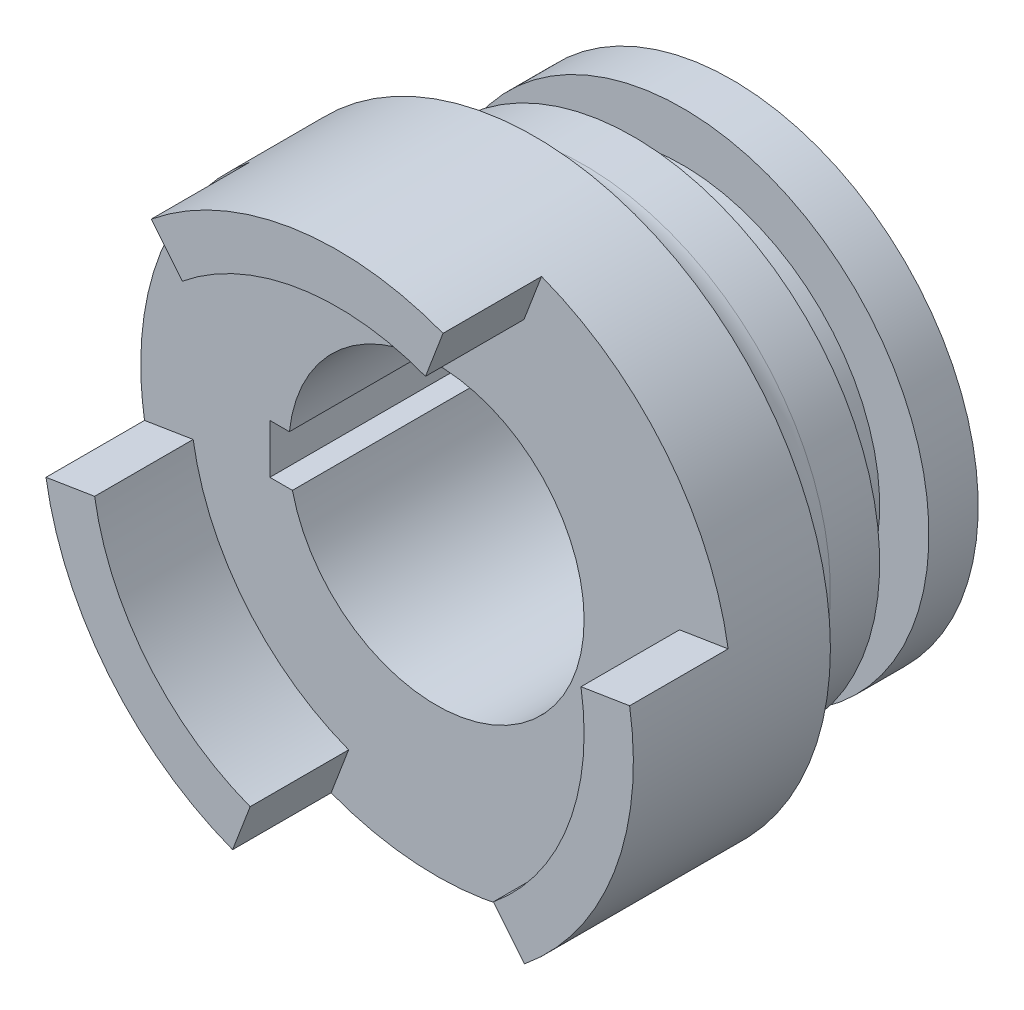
ISO-10303-21;
HEADER;
FILE_DESCRIPTION(('STEP AP214'),'2;1');
FILE_NAME('part.step','',(''),(''),'','','');
FILE_SCHEMA(('AUTOMOTIVE_DESIGN { 1 0 10303 214 1 1 1 1 }'));
ENDSEC;
DATA;
#1=APPLICATION_CONTEXT('core data for automotive mechanical design processes');
#2=APPLICATION_PROTOCOL_DEFINITION('international standard','automotive_design',2000,#1);
#3=PRODUCT_CONTEXT('',#1,'mechanical');
#4=PRODUCT('Part','Part','',(#3));
#5=PRODUCT_RELATED_PRODUCT_CATEGORY('part','',(#4));
#6=PRODUCT_DEFINITION_FORMATION('','',#4);
#7=PRODUCT_DEFINITION_CONTEXT('part definition',#1,'design');
#8=PRODUCT_DEFINITION('design','',#6,#7);
#9=PRODUCT_DEFINITION_SHAPE('','',#8);
#10=(LENGTH_UNIT() NAMED_UNIT(*) SI_UNIT(.MILLI.,.METRE.));
#11=(NAMED_UNIT(*) PLANE_ANGLE_UNIT() SI_UNIT($,.RADIAN.));
#12=(NAMED_UNIT(*) SI_UNIT($,.STERADIAN.) SOLID_ANGLE_UNIT());
#13=UNCERTAINTY_MEASURE_WITH_UNIT(LENGTH_MEASURE(1.E-05),#10,'distance_accuracy_value','');
#14=(GEOMETRIC_REPRESENTATION_CONTEXT(3) GLOBAL_UNCERTAINTY_ASSIGNED_CONTEXT((#13)) GLOBAL_UNIT_ASSIGNED_CONTEXT((#10,
#11,#12)) REPRESENTATION_CONTEXT('',''));
#15=CARTESIAN_POINT('',(0.,0.,0.));
#16=DIRECTION('',(0.,0.,1.));
#17=DIRECTION('',(1.,0.,0.));
#18=AXIS2_PLACEMENT_3D('',#15,#16,#17);
#19=CARTESIAN_POINT('',(-18.1237635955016,-40.2530135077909,51.980983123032));
#20=DIRECTION('',(0.,0.,-1.));
#21=DIRECTION('',(-1.,0.,0.));
#22=AXIS2_PLACEMENT_3D('',#19,#20,#21);
#23=PLANE('',#22);
#24=DIRECTION('',(1.,0.,0.));
#25=VECTOR('',#24,1.);
#26=CARTESIAN_POINT('',(-18.1237635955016,-38.6621044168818,51.980983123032));
#27=LINE('',#26,#25);
#28=CARTESIAN_POINT('',(-35.0190881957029,-38.6621044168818,51.980983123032));
#29=VERTEX_POINT('',#28);
#30=CARTESIAN_POINT('',(-33.039158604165,-38.6621044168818,51.980983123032));
#31=VERTEX_POINT('',#30);
#32=EDGE_CURVE('E177',#29,#31,#27,.T.);
#33=ORIENTED_EDGE('',*,*,#32,.T.);
#34=CARTESIAN_POINT('',(-18.1237635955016,-40.2530135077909,51.980983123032));
#35=DIRECTION('',(0.,0.,-1.));
#36=DIRECTION('',(-1.,0.,0.));
#37=AXIS2_PLACEMENT_3D('',#34,#35,#36);
#38=CIRCLE('',#37,15.);
#39=CARTESIAN_POINT('',(-32.7312308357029,-43.6621044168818,51.980983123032));
#40=VERTEX_POINT('',#39);
#41=EDGE_CURVE('E180',#31,#40,#38,.T.);
#42=ORIENTED_EDGE('',*,*,#41,.T.);
#43=DIRECTION('',(-1.,0.,0.));
#44=VECTOR('',#43,1.);
#45=CARTESIAN_POINT('',(-18.1237635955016,-43.6621044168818,51.980983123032));
#46=LINE('',#45,#44);
#47=CARTESIAN_POINT('',(-35.0190881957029,-43.6621044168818,51.980983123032));
#48=VERTEX_POINT('',#47);
#49=EDGE_CURVE('E172',#40,#48,#46,.T.);
#50=ORIENTED_EDGE('',*,*,#49,.T.);
#51=DIRECTION('',(0.,1.,0.));
#52=VECTOR('',#51,1.);
#53=CARTESIAN_POINT('',(-35.0190881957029,-40.2530135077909,51.980983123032));
#54=LINE('',#53,#52);
#55=EDGE_CURVE('E152',#48,#29,#54,.T.);
#56=ORIENTED_EDGE('',*,*,#55,.T.);
#57=EDGE_LOOP('',(#33,#42,#50,#56));
#58=FACE_BOUND('',#57,.T.);
#59=DIRECTION('',(0.355977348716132,0.934494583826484,0.));
#60=VECTOR('',#59,1.);
#61=CARTESIAN_POINT('',(-28.8030840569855,-68.2878510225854,51.980983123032));
#62=LINE('',#61,#60);
#63=CARTESIAN_POINT('',(-28.8030840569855,-68.2878510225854,51.980983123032));
#64=VERTEX_POINT('',#63);
#65=CARTESIAN_POINT('',(-27.0231973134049,-63.615378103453,51.980983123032));
#66=VERTEX_POINT('',#65);
#67=EDGE_CURVE('E198',#64,#66,#62,.T.);
#68=ORIENTED_EDGE('',*,*,#67,.F.);
#69=CARTESIAN_POINT('',(-18.1237635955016,-40.2530135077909,51.980983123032));
#70=DIRECTION('',(0.,0.,-1.));
#71=DIRECTION('',(-1.,0.,0.));
#72=AXIS2_PLACEMENT_3D('',#69,#70,#71);
#73=CIRCLE('',#72,30.);
#74=CARTESIAN_POINT('',(0.815457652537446,-63.5189950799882,51.980983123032));
#75=VERTEX_POINT('',#74);
#76=EDGE_CURVE('E262',#75,#64,#73,.T.);
#77=ORIENTED_EDGE('',*,*,#76,.F.);
#78=DIRECTION('',(0.631307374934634,-0.775532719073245,0.));
#79=VECTOR('',#78,1.);
#80=CARTESIAN_POINT('',(0.815457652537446,-63.5189950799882,51.980983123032));
#81=LINE('',#80,#79);
#82=CARTESIAN_POINT('',(-2.34107922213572,-59.641331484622,51.980983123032));
#83=VERTEX_POINT('',#82);
#84=EDGE_CURVE('E229',#83,#75,#81,.T.);
#85=ORIENTED_EDGE('',*,*,#84,.F.);
#86=CARTESIAN_POINT('',(-18.1237635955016,-40.2530135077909,51.980983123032));
#87=DIRECTION('',(0.,0.,-1.));
#88=DIRECTION('',(-1.,0.,0.));
#89=AXIS2_PLACEMENT_3D('',#86,#87,#88);
#90=CIRCLE('',#89,25.);
#91=CARTESIAN_POINT('',(6.55835449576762,-36.2789668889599,51.980983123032));
#92=VERTEX_POINT('',#91);
#93=EDGE_CURVE('E238',#92,#83,#90,.T.);
#94=ORIENTED_EDGE('',*,*,#93,.F.);
#95=DIRECTION('',(-0.987284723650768,-0.15896186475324,0.));
#96=VECTOR('',#95,1.);
#97=CARTESIAN_POINT('',(11.4947781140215,-35.4841575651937,51.980983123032));
#98=LINE('',#97,#96);
#99=CARTESIAN_POINT('',(11.4947781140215,-35.4841575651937,51.980983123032));
#100=VERTEX_POINT('',#99);
#101=EDGE_CURVE('E224',#100,#92,#98,.T.);
#102=ORIENTED_EDGE('',*,*,#101,.F.);
#103=CARTESIAN_POINT('',(-7.44444313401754,-12.2181759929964,51.980983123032));
#104=VERTEX_POINT('',#103);
#105=EDGE_CURVE('E259',#104,#100,#73,.T.);
#106=ORIENTED_EDGE('',*,*,#105,.F.);
#107=DIRECTION('',(0.355977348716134,0.934494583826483,0.));
#108=VECTOR('',#107,1.);
#109=CARTESIAN_POINT('',(-7.44444313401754,-12.2181759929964,51.980983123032));
#110=LINE('',#109,#108);
#111=CARTESIAN_POINT('',(-9.22432987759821,-16.8906489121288,51.980983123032));
#112=VERTEX_POINT('',#111);
#113=EDGE_CURVE('E267',#112,#104,#110,.T.);
#114=ORIENTED_EDGE('',*,*,#113,.F.);
#115=CARTESIAN_POINT('',(-18.1237635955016,-40.2530135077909,51.980983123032));
#116=DIRECTION('',(0.,0.,-1.));
#117=DIRECTION('',(-1.,0.,0.));
#118=AXIS2_PLACEMENT_3D('',#115,#116,#117);
#119=CIRCLE('',#118,25.);
#120=CARTESIAN_POINT('',(-33.9064479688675,-20.8646955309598,51.980983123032));
#121=VERTEX_POINT('',#120);
#122=EDGE_CURVE('E276',#121,#112,#119,.T.);
#123=ORIENTED_EDGE('',*,*,#122,.F.);
#124=DIRECTION('',(0.631307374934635,-0.775532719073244,0.));
#125=VECTOR('',#124,1.);
#126=CARTESIAN_POINT('',(-37.0629848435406,-16.9870319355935,51.980983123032));
#127=LINE('',#126,#125);
#128=CARTESIAN_POINT('',(-37.0629848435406,-16.9870319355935,51.980983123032));
#129=VERTEX_POINT('',#128);
#130=EDGE_CURVE('E258',#129,#121,#127,.T.);
#131=ORIENTED_EDGE('',*,*,#130,.F.);
#132=CARTESIAN_POINT('',(-47.7423053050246,-45.021869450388,51.980983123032));
#133=VERTEX_POINT('',#132);
#134=EDGE_CURVE('E254',#133,#129,#73,.T.);
#135=ORIENTED_EDGE('',*,*,#134,.F.);
#136=DIRECTION('',(-0.987284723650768,-0.158961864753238,0.));
#137=VECTOR('',#136,1.);
#138=CARTESIAN_POINT('',(-47.7423053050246,-45.021869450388,51.980983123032));
#139=LINE('',#138,#137);
#140=CARTESIAN_POINT('',(-42.8058816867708,-44.2270601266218,51.980983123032));
#141=VERTEX_POINT('',#140);
#142=EDGE_CURVE('E203',#141,#133,#139,.T.);
#143=ORIENTED_EDGE('',*,*,#142,.F.);
#144=CARTESIAN_POINT('',(-18.1237635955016,-40.2530135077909,51.980983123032));
#145=DIRECTION('',(0.,0.,-1.));
#146=DIRECTION('',(-1.,0.,0.));
#147=AXIS2_PLACEMENT_3D('',#144,#145,#146);
#148=CIRCLE('',#147,25.);
#149=EDGE_CURVE('E211',#66,#141,#148,.T.);
#150=ORIENTED_EDGE('',*,*,#149,.F.);
#151=EDGE_LOOP('',(#68,#77,#85,#94,#102,#106,#114,#123,#131,#135,#143,#150));
#152=FACE_BOUND('',#151,.T.);
#153=ADVANCED_FACE('F33',(#58,#152),#23,.F.);
#154=CARTESIAN_POINT('',(-18.1237635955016,-40.2530135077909,61.980983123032));
#155=DIRECTION('',(0.,0.,-1.));
#156=DIRECTION('',(-1.,0.,0.));
#157=AXIS2_PLACEMENT_3D('',#154,#155,#156);
#158=CYLINDRICAL_SURFACE('',#157,30.);
#159=DIRECTION('',(0.,0.,-1.));
#160=VECTOR('',#159,1.);
#161=CARTESIAN_POINT('',(-7.44444313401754,-12.2181759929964,61.980983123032));
#162=LINE('',#161,#160);
#163=CARTESIAN_POINT('',(-7.44444313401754,-12.2181759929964,61.980983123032));
#164=VERTEX_POINT('',#163);
#165=EDGE_CURVE('E273',#164,#104,#162,.T.);
#166=ORIENTED_EDGE('',*,*,#165,.T.);
#167=ORIENTED_EDGE('',*,*,#105,.T.);
#168=DIRECTION('',(0.,0.,-1.));
#169=VECTOR('',#168,1.);
#170=CARTESIAN_POINT('',(11.4947781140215,-35.4841575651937,61.980983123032));
#171=LINE('',#170,#169);
#172=CARTESIAN_POINT('',(11.4947781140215,-35.4841575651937,61.980983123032));
#173=VERTEX_POINT('',#172);
#174=EDGE_CURVE('E251',#173,#100,#171,.T.);
#175=ORIENTED_EDGE('',*,*,#174,.F.);
#176=CARTESIAN_POINT('',(-18.1237635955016,-40.2530135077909,61.980983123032));
#177=DIRECTION('',(0.,0.,1.));
#178=DIRECTION('',(1.,0.,0.));
#179=AXIS2_PLACEMENT_3D('',#176,#177,#178);
#180=CIRCLE('',#179,30.);
#181=CARTESIAN_POINT('',(0.815457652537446,-63.5189950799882,61.980983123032));
#182=VERTEX_POINT('',#181);
#183=EDGE_CURVE('E225',#182,#173,#180,.T.);
#184=ORIENTED_EDGE('',*,*,#183,.F.);
#185=DIRECTION('',(0.,0.,-1.));
#186=VECTOR('',#185,1.);
#187=CARTESIAN_POINT('',(0.815457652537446,-63.5189950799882,61.980983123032));
#188=LINE('',#187,#186);
#189=EDGE_CURVE('E235',#182,#75,#188,.T.);
#190=ORIENTED_EDGE('',*,*,#189,.T.);
#191=ORIENTED_EDGE('',*,*,#76,.T.);
#192=DIRECTION('',(0.,0.,-1.));
#193=VECTOR('',#192,1.);
#194=CARTESIAN_POINT('',(-28.8030840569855,-68.2878510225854,61.980983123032));
#195=LINE('',#194,#193);
#196=CARTESIAN_POINT('',(-28.8030840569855,-68.2878510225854,61.980983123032));
#197=VERTEX_POINT('',#196);
#198=EDGE_CURVE('E222',#197,#64,#195,.T.);
#199=ORIENTED_EDGE('',*,*,#198,.F.);
#200=CARTESIAN_POINT('',(-18.1237635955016,-40.2530135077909,61.980983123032));
#201=DIRECTION('',(0.,0.,1.));
#202=DIRECTION('',(1.,0.,0.));
#203=AXIS2_PLACEMENT_3D('',#200,#201,#202);
#204=CIRCLE('',#203,30.);
#205=CARTESIAN_POINT('',(-47.7423053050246,-45.021869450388,61.980983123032));
#206=VERTEX_POINT('',#205);
#207=EDGE_CURVE('E199',#206,#197,#204,.T.);
#208=ORIENTED_EDGE('',*,*,#207,.F.);
#209=DIRECTION('',(0.,0.,-1.));
#210=VECTOR('',#209,1.);
#211=CARTESIAN_POINT('',(-47.7423053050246,-45.021869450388,61.980983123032));
#212=LINE('',#211,#210);
#213=EDGE_CURVE('E209',#206,#133,#212,.T.);
#214=ORIENTED_EDGE('',*,*,#213,.T.);
#215=ORIENTED_EDGE('',*,*,#134,.T.);
#216=DIRECTION('',(0.,0.,-1.));
#217=VECTOR('',#216,1.);
#218=CARTESIAN_POINT('',(-37.0629848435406,-16.9870319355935,61.980983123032));
#219=LINE('',#218,#217);
#220=CARTESIAN_POINT('',(-37.0629848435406,-16.9870319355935,61.980983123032));
#221=VERTEX_POINT('',#220);
#222=EDGE_CURVE('E41',#221,#129,#219,.T.);
#223=ORIENTED_EDGE('',*,*,#222,.F.);
#224=CARTESIAN_POINT('',(-18.1237635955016,-40.2530135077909,61.980983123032));
#225=DIRECTION('',(0.,0.,1.));
#226=DIRECTION('',(1.,0.,0.));
#227=AXIS2_PLACEMENT_3D('',#224,#225,#226);
#228=CIRCLE('',#227,30.);
#229=EDGE_CURVE('E263',#164,#221,#228,.T.);
#230=ORIENTED_EDGE('',*,*,#229,.F.);
#231=EDGE_LOOP('',(#166,#167,#175,#184,#190,#191,#199,#208,#214,#215,#223,#230));
#232=FACE_BOUND('',#231,.T.);
#233=CARTESIAN_POINT('',(-18.1237635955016,-40.2530135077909,41.980983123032));
#234=DIRECTION('',(0.,0.,-1.));
#235=DIRECTION('',(-1.,0.,0.));
#236=AXIS2_PLACEMENT_3D('',#233,#234,#235);
#237=CIRCLE('',#236,30.);
#238=CARTESIAN_POINT('',(-48.1237635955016,-40.2530135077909,41.980983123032));
#239=VERTEX_POINT('',#238);
#240=EDGE_CURVE('E255',#239,#239,#237,.T.);
#241=ORIENTED_EDGE('',*,*,#240,.F.);
#242=EDGE_LOOP('',(#241));
#243=FACE_BOUND('',#242,.T.);
#244=ADVANCED_FACE('F296',(#232,#243),#158,.T.);
#245=CARTESIAN_POINT('',(-37.0629848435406,-16.9870319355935,61.980983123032));
#246=DIRECTION('',(0.775532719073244,0.631307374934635,0.));
#247=DIRECTION('',(-0.631307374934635,0.775532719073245,0.));
#248=AXIS2_PLACEMENT_3D('',#245,#246,#247);
#249=PLANE('',#248);
#250=ORIENTED_EDGE('',*,*,#130,.T.);
#251=DIRECTION('',(0.,0.,-1.));
#252=VECTOR('',#251,1.);
#253=CARTESIAN_POINT('',(-33.9064479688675,-20.8646955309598,61.980983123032));
#254=LINE('',#253,#252);
#255=CARTESIAN_POINT('',(-33.9064479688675,-20.8646955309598,61.980983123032));
#256=VERTEX_POINT('',#255);
#257=EDGE_CURVE('E286',#256,#121,#254,.T.);
#258=ORIENTED_EDGE('',*,*,#257,.F.);
#259=DIRECTION('',(0.631307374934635,-0.775532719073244,0.));
#260=VECTOR('',#259,1.);
#261=CARTESIAN_POINT('',(-37.0629848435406,-16.9870319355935,61.980983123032));
#262=LINE('',#261,#260);
#263=EDGE_CURVE('E266',#221,#256,#262,.T.);
#264=ORIENTED_EDGE('',*,*,#263,.F.);
#265=ORIENTED_EDGE('',*,*,#222,.T.);
#266=EDGE_LOOP('',(#250,#258,#264,#265));
#267=FACE_BOUND('',#266,.T.);
#268=ADVANCED_FACE('F291',(#267),#249,.F.);
#269=CARTESIAN_POINT('',(-18.1237635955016,-40.2530135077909,61.980983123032));
#270=DIRECTION('',(0.,0.,-1.));
#271=DIRECTION('',(-1.,0.,0.));
#272=AXIS2_PLACEMENT_3D('',#269,#270,#271);
#273=CYLINDRICAL_SURFACE('',#272,25.);
#274=ORIENTED_EDGE('',*,*,#122,.T.);
#275=DIRECTION('',(0.,0.,-1.));
#276=VECTOR('',#275,1.);
#277=CARTESIAN_POINT('',(-9.22432987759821,-16.8906489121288,61.980983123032));
#278=LINE('',#277,#276);
#279=CARTESIAN_POINT('',(-9.22432987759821,-16.8906489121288,61.980983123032));
#280=VERTEX_POINT('',#279);
#281=EDGE_CURVE('E283',#280,#112,#278,.T.);
#282=ORIENTED_EDGE('',*,*,#281,.F.);
#283=CARTESIAN_POINT('',(-18.1237635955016,-40.2530135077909,61.980983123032));
#284=DIRECTION('',(0.,0.,-1.));
#285=DIRECTION('',(-1.,0.,0.));
#286=AXIS2_PLACEMENT_3D('',#283,#284,#285);
#287=CIRCLE('',#286,25.);
#288=EDGE_CURVE('E269',#256,#280,#287,.T.);
#289=ORIENTED_EDGE('',*,*,#288,.F.);
#290=ORIENTED_EDGE('',*,*,#257,.T.);
#291=EDGE_LOOP('',(#274,#282,#289,#290));
#292=FACE_BOUND('',#291,.T.);
#293=ADVANCED_FACE('F306',(#292),#273,.F.);
#294=CARTESIAN_POINT('',(-7.44444313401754,-12.2181759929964,61.980983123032));
#295=DIRECTION('',(-0.934494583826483,0.355977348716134,0.));
#296=DIRECTION('',(-0.355977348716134,-0.934494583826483,0.));
#297=AXIS2_PLACEMENT_3D('',#294,#295,#296);
#298=PLANE('',#297);
#299=ORIENTED_EDGE('',*,*,#113,.T.);
#300=ORIENTED_EDGE('',*,*,#165,.F.);
#301=DIRECTION('',(0.355977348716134,0.934494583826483,0.));
#302=VECTOR('',#301,1.);
#303=CARTESIAN_POINT('',(-7.44444313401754,-12.2181759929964,61.980983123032));
#304=LINE('',#303,#302);
#305=EDGE_CURVE('E271',#280,#164,#304,.T.);
#306=ORIENTED_EDGE('',*,*,#305,.F.);
#307=ORIENTED_EDGE('',*,*,#281,.T.);
#308=EDGE_LOOP('',(#299,#300,#306,#307));
#309=FACE_BOUND('',#308,.T.);
#310=ADVANCED_FACE('F310',(#309),#298,.F.);
#311=CARTESIAN_POINT('',(-18.1237635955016,-40.2530135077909,61.980983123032));
#312=DIRECTION('',(0.,0.,1.));
#313=DIRECTION('',(1.,0.,0.));
#314=AXIS2_PLACEMENT_3D('',#311,#312,#313);
#315=PLANE('',#314);
#316=ORIENTED_EDGE('',*,*,#229,.T.);
#317=ORIENTED_EDGE('',*,*,#263,.T.);
#318=ORIENTED_EDGE('',*,*,#288,.T.);
#319=ORIENTED_EDGE('',*,*,#305,.T.);
#320=EDGE_LOOP('',(#316,#317,#318,#319));
#321=FACE_BOUND('',#320,.T.);
#322=ADVANCED_FACE('F313',(#321),#315,.T.);
#323=CARTESIAN_POINT('',(11.4947781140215,-35.4841575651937,61.980983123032));
#324=DIRECTION('',(0.15896186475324,-0.987284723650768,0.));
#325=DIRECTION('',(0.987284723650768,0.15896186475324,0.));
#326=AXIS2_PLACEMENT_3D('',#323,#324,#325);
#327=PLANE('',#326);
#328=ORIENTED_EDGE('',*,*,#101,.T.);
#329=DIRECTION('',(0.,0.,-1.));
#330=VECTOR('',#329,1.);
#331=CARTESIAN_POINT('',(6.55835449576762,-36.2789668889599,61.980983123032));
#332=LINE('',#331,#330);
#333=CARTESIAN_POINT('',(6.55835449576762,-36.2789668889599,61.980983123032));
#334=VERTEX_POINT('',#333);
#335=EDGE_CURVE('E248',#334,#92,#332,.T.);
#336=ORIENTED_EDGE('',*,*,#335,.F.);
#337=DIRECTION('',(-0.987284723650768,-0.15896186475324,0.));
#338=VECTOR('',#337,1.);
#339=CARTESIAN_POINT('',(11.4947781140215,-35.4841575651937,61.980983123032));
#340=LINE('',#339,#338);
#341=EDGE_CURVE('E228',#173,#334,#340,.T.);
#342=ORIENTED_EDGE('',*,*,#341,.F.);
#343=ORIENTED_EDGE('',*,*,#174,.T.);
#344=EDGE_LOOP('',(#328,#336,#342,#343));
#345=FACE_BOUND('',#344,.T.);
#346=ADVANCED_FACE('F315',(#345),#327,.F.);
#347=CARTESIAN_POINT('',(-18.1237635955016,-40.2530135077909,61.980983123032));
#348=DIRECTION('',(0.,0.,-1.));
#349=DIRECTION('',(-1.,0.,0.));
#350=AXIS2_PLACEMENT_3D('',#347,#348,#349);
#351=CYLINDRICAL_SURFACE('',#350,25.);
#352=ORIENTED_EDGE('',*,*,#93,.T.);
#353=DIRECTION('',(0.,0.,-1.));
#354=VECTOR('',#353,1.);
#355=CARTESIAN_POINT('',(-2.34107922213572,-59.641331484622,61.980983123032));
#356=LINE('',#355,#354);
#357=CARTESIAN_POINT('',(-2.34107922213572,-59.641331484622,61.980983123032));
#358=VERTEX_POINT('',#357);
#359=EDGE_CURVE('E245',#358,#83,#356,.T.);
#360=ORIENTED_EDGE('',*,*,#359,.F.);
#361=CARTESIAN_POINT('',(-18.1237635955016,-40.2530135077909,61.980983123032));
#362=DIRECTION('',(0.,0.,-1.));
#363=DIRECTION('',(-1.,0.,0.));
#364=AXIS2_PLACEMENT_3D('',#361,#362,#363);
#365=CIRCLE('',#364,25.);
#366=EDGE_CURVE('E231',#334,#358,#365,.T.);
#367=ORIENTED_EDGE('',*,*,#366,.F.);
#368=ORIENTED_EDGE('',*,*,#335,.T.);
#369=EDGE_LOOP('',(#352,#360,#367,#368));
#370=FACE_BOUND('',#369,.T.);
#371=ADVANCED_FACE('F321',(#370),#351,.F.);
#372=CARTESIAN_POINT('',(0.815457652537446,-63.5189950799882,61.980983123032));
#373=DIRECTION('',(0.775532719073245,0.631307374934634,0.));
#374=DIRECTION('',(-0.631307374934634,0.775532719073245,0.));
#375=AXIS2_PLACEMENT_3D('',#372,#373,#374);
#376=PLANE('',#375);
#377=ORIENTED_EDGE('',*,*,#84,.T.);
#378=ORIENTED_EDGE('',*,*,#189,.F.);
#379=DIRECTION('',(0.631307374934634,-0.775532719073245,0.));
#380=VECTOR('',#379,1.);
#381=CARTESIAN_POINT('',(0.815457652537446,-63.5189950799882,61.980983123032));
#382=LINE('',#381,#380);
#383=EDGE_CURVE('E233',#358,#182,#382,.T.);
#384=ORIENTED_EDGE('',*,*,#383,.F.);
#385=ORIENTED_EDGE('',*,*,#359,.T.);
#386=EDGE_LOOP('',(#377,#378,#384,#385));
#387=FACE_BOUND('',#386,.T.);
#388=ADVANCED_FACE('F334',(#387),#376,.F.);
#389=CARTESIAN_POINT('',(-18.1237635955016,-40.2530135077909,61.980983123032));
#390=DIRECTION('',(0.,0.,1.));
#391=DIRECTION('',(1.,0.,0.));
#392=AXIS2_PLACEMENT_3D('',#389,#390,#391);
#393=PLANE('',#392);
#394=ORIENTED_EDGE('',*,*,#183,.T.);
#395=ORIENTED_EDGE('',*,*,#341,.T.);
#396=ORIENTED_EDGE('',*,*,#366,.T.);
#397=ORIENTED_EDGE('',*,*,#383,.T.);
#398=EDGE_LOOP('',(#394,#395,#396,#397));
#399=FACE_BOUND('',#398,.T.);
#400=ADVANCED_FACE('F338',(#399),#393,.T.);
#401=CARTESIAN_POINT('',(-28.8030840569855,-68.2878510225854,61.980983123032));
#402=DIRECTION('',(-0.934494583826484,0.355977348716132,0.));
#403=DIRECTION('',(-0.355977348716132,-0.934494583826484,0.));
#404=AXIS2_PLACEMENT_3D('',#401,#402,#403);
#405=PLANE('',#404);
#406=ORIENTED_EDGE('',*,*,#67,.T.);
#407=DIRECTION('',(0.,0.,-1.));
#408=VECTOR('',#407,1.);
#409=CARTESIAN_POINT('',(-27.0231973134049,-63.615378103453,61.980983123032));
#410=LINE('',#409,#408);
#411=CARTESIAN_POINT('',(-27.0231973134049,-63.615378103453,61.980983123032));
#412=VERTEX_POINT('',#411);
#413=EDGE_CURVE('E219',#412,#66,#410,.T.);
#414=ORIENTED_EDGE('',*,*,#413,.F.);
#415=DIRECTION('',(0.355977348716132,0.934494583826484,0.));
#416=VECTOR('',#415,1.);
#417=CARTESIAN_POINT('',(-28.8030840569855,-68.2878510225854,61.980983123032));
#418=LINE('',#417,#416);
#419=EDGE_CURVE('E202',#197,#412,#418,.T.);
#420=ORIENTED_EDGE('',*,*,#419,.F.);
#421=ORIENTED_EDGE('',*,*,#198,.T.);
#422=EDGE_LOOP('',(#406,#414,#420,#421));
#423=FACE_BOUND('',#422,.T.);
#424=ADVANCED_FACE('F342',(#423),#405,.F.);
#425=CARTESIAN_POINT('',(-18.1237635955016,-40.2530135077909,61.980983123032));
#426=DIRECTION('',(0.,0.,-1.));
#427=DIRECTION('',(-1.,0.,0.));
#428=AXIS2_PLACEMENT_3D('',#425,#426,#427);
#429=CYLINDRICAL_SURFACE('',#428,25.);
#430=ORIENTED_EDGE('',*,*,#149,.T.);
#431=DIRECTION('',(0.,0.,-1.));
#432=VECTOR('',#431,1.);
#433=CARTESIAN_POINT('',(-42.8058816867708,-44.2270601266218,61.980983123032));
#434=LINE('',#433,#432);
#435=CARTESIAN_POINT('',(-42.8058816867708,-44.2270601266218,61.980983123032));
#436=VERTEX_POINT('',#435);
#437=EDGE_CURVE('E216',#436,#141,#434,.T.);
#438=ORIENTED_EDGE('',*,*,#437,.F.);
#439=CARTESIAN_POINT('',(-18.1237635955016,-40.2530135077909,61.980983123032));
#440=DIRECTION('',(0.,0.,-1.));
#441=DIRECTION('',(-1.,0.,0.));
#442=AXIS2_PLACEMENT_3D('',#439,#440,#441);
#443=CIRCLE('',#442,25.);
#444=EDGE_CURVE('E205',#412,#436,#443,.T.);
#445=ORIENTED_EDGE('',*,*,#444,.F.);
#446=ORIENTED_EDGE('',*,*,#413,.T.);
#447=EDGE_LOOP('',(#430,#438,#445,#446));
#448=FACE_BOUND('',#447,.T.);
#449=ADVANCED_FACE('F346',(#448),#429,.F.);
#450=CARTESIAN_POINT('',(-47.7423053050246,-45.021869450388,61.980983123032));
#451=DIRECTION('',(0.158961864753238,-0.987284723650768,0.));
#452=DIRECTION('',(0.987284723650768,0.158961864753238,0.));
#453=AXIS2_PLACEMENT_3D('',#450,#451,#452);
#454=PLANE('',#453);
#455=ORIENTED_EDGE('',*,*,#142,.T.);
#456=ORIENTED_EDGE('',*,*,#213,.F.);
#457=DIRECTION('',(-0.987284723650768,-0.158961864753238,0.));
#458=VECTOR('',#457,1.);
#459=CARTESIAN_POINT('',(-47.7423053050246,-45.021869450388,61.980983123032));
#460=LINE('',#459,#458);
#461=EDGE_CURVE('E207',#436,#206,#460,.T.);
#462=ORIENTED_EDGE('',*,*,#461,.F.);
#463=ORIENTED_EDGE('',*,*,#437,.T.);
#464=EDGE_LOOP('',(#455,#456,#462,#463));
#465=FACE_BOUND('',#464,.T.);
#466=ADVANCED_FACE('F350',(#465),#454,.F.);
#467=CARTESIAN_POINT('',(-18.1237635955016,-40.2530135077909,61.980983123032));
#468=DIRECTION('',(0.,0.,1.));
#469=DIRECTION('',(1.,0.,0.));
#470=AXIS2_PLACEMENT_3D('',#467,#468,#469);
#471=PLANE('',#470);
#472=ORIENTED_EDGE('',*,*,#207,.T.);
#473=ORIENTED_EDGE('',*,*,#419,.T.);
#474=ORIENTED_EDGE('',*,*,#444,.T.);
#475=ORIENTED_EDGE('',*,*,#461,.T.);
#476=EDGE_LOOP('',(#472,#473,#474,#475));
#477=FACE_BOUND('',#476,.T.);
#478=ADVANCED_FACE('F354',(#477),#471,.T.);
#479=CARTESIAN_POINT('',(-18.1237635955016,-40.2530135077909,31.980983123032));
#480=DIRECTION('',(0.,0.,1.));
#481=DIRECTION('',(1.,0.,0.));
#482=AXIS2_PLACEMENT_3D('',#479,#480,#481);
#483=CYLINDRICAL_SURFACE('',#482,25.);
#484=CARTESIAN_POINT('',(-18.1237635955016,-40.2530135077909,36.980983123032));
#485=DIRECTION('',(0.,0.,-1.));
#486=DIRECTION('',(-1.,0.,0.));
#487=AXIS2_PLACEMENT_3D('',#484,#485,#486);
#488=CIRCLE('',#487,25.);
#489=CARTESIAN_POINT('',(-43.1237635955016,-40.2530135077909,36.980983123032));
#490=VERTEX_POINT('',#489);
#491=EDGE_CURVE('E11',#490,#490,#488,.T.);
#492=ORIENTED_EDGE('',*,*,#491,.T.);
#493=EDGE_LOOP('',(#492));
#494=FACE_BOUND('',#493,.T.);
#495=CARTESIAN_POINT('',(-18.1237635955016,-40.2530135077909,31.980983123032));
#496=DIRECTION('',(0.,0.,-1.));
#497=DIRECTION('',(-1.,0.,0.));
#498=AXIS2_PLACEMENT_3D('',#495,#496,#497);
#499=CIRCLE('',#498,25.);
#500=CARTESIAN_POINT('',(-43.1237635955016,-40.2530135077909,31.980983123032));
#501=VERTEX_POINT('',#500);
#502=EDGE_CURVE('E193',#501,#501,#499,.T.);
#503=ORIENTED_EDGE('',*,*,#502,.F.);
#504=EDGE_LOOP('',(#503));
#505=FACE_BOUND('',#504,.T.);
#506=ADVANCED_FACE('F358',(#494,#505),#483,.T.);
#507=CARTESIAN_POINT('',(-18.1237635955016,-40.2530135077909,31.980983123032));
#508=DIRECTION('',(0.,0.,-1.));
#509=DIRECTION('',(-1.,0.,0.));
#510=AXIS2_PLACEMENT_3D('',#507,#508,#509);
#511=PLANE('',#510);
#512=CARTESIAN_POINT('',(-18.1237635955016,-40.2530135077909,31.980983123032));
#513=DIRECTION('',(0.,0.,-1.));
#514=DIRECTION('',(-1.,0.,0.));
#515=AXIS2_PLACEMENT_3D('',#512,#513,#514);
#516=CIRCLE('',#515,20.);
#517=CARTESIAN_POINT('',(-38.1237635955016,-40.2530135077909,31.980983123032));
#518=VERTEX_POINT('',#517);
#519=EDGE_CURVE('E187',#518,#518,#516,.T.);
#520=ORIENTED_EDGE('',*,*,#519,.F.);
#521=EDGE_LOOP('',(#520));
#522=FACE_BOUND('',#521,.T.);
#523=ORIENTED_EDGE('',*,*,#502,.T.);
#524=EDGE_LOOP('',(#523));
#525=FACE_BOUND('',#524,.T.);
#526=ADVANCED_FACE('F362',(#522,#525),#511,.T.);
#527=CARTESIAN_POINT('',(-18.1237635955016,-40.2530135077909,36.980983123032));
#528=DIRECTION('',(0.,0.,-1.));
#529=DIRECTION('',(-1.,0.,0.));
#530=AXIS2_PLACEMENT_3D('',#527,#528,#529);
#531=TOROIDAL_SURFACE('',#530,30.,5.);
#532=ORIENTED_EDGE('',*,*,#240,.T.);
#533=EDGE_LOOP('',(#532));
#534=FACE_BOUND('',#533,.T.);
#535=ORIENTED_EDGE('',*,*,#491,.F.);
#536=EDGE_LOOP('',(#535));
#537=FACE_BOUND('',#536,.T.);
#538=ADVANCED_FACE('F35',(#534,#537),#531,.F.);
#539=CARTESIAN_POINT('',(-18.1237635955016,-40.2530135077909,26.980983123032));
#540=DIRECTION('',(0.,0.,1.));
#541=DIRECTION('',(1.,0.,0.));
#542=AXIS2_PLACEMENT_3D('',#539,#540,#541);
#543=CYLINDRICAL_SURFACE('',#542,20.);
#544=CARTESIAN_POINT('',(-18.1237635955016,-40.2530135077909,26.980983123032));
#545=DIRECTION('',(0.,0.,-1.));
#546=DIRECTION('',(-1.,0.,0.));
#547=AXIS2_PLACEMENT_3D('',#544,#545,#546);
#548=CIRCLE('',#547,20.);
#549=CARTESIAN_POINT('',(-38.1237635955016,-40.2530135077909,26.980983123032));
#550=VERTEX_POINT('',#549);
#551=EDGE_CURVE('E190',#550,#550,#548,.T.);
#552=ORIENTED_EDGE('',*,*,#551,.F.);
#553=EDGE_LOOP('',(#552));
#554=FACE_BOUND('',#553,.T.);
#555=ORIENTED_EDGE('',*,*,#519,.T.);
#556=EDGE_LOOP('',(#555));
#557=FACE_BOUND('',#556,.T.);
#558=ADVANCED_FACE('F367',(#554,#557),#543,.T.);
#559=CARTESIAN_POINT('',(-18.1237635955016,-40.2530135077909,21.980983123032));
#560=DIRECTION('',(0.,0.,1.));
#561=DIRECTION('',(1.,0.,0.));
#562=AXIS2_PLACEMENT_3D('',#559,#560,#561);
#563=CYLINDRICAL_SURFACE('',#562,25.);
#564=CARTESIAN_POINT('',(-18.1237635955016,-40.2530135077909,21.980983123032));
#565=DIRECTION('',(0.,0.,-1.));
#566=DIRECTION('',(-1.,0.,0.));
#567=AXIS2_PLACEMENT_3D('',#564,#565,#566);
#568=CIRCLE('',#567,25.);
#569=CARTESIAN_POINT('',(-43.1237635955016,-40.2530135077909,21.980983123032));
#570=VERTEX_POINT('',#569);
#571=EDGE_CURVE('E184',#570,#570,#568,.T.);
#572=ORIENTED_EDGE('',*,*,#571,.F.);
#573=EDGE_LOOP('',(#572));
#574=FACE_BOUND('',#573,.T.);
#575=CARTESIAN_POINT('',(-18.1237635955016,-40.2530135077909,26.980983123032));
#576=DIRECTION('',(0.,0.,-1.));
#577=DIRECTION('',(-1.,0.,0.));
#578=AXIS2_PLACEMENT_3D('',#575,#576,#577);
#579=CIRCLE('',#578,25.);
#580=CARTESIAN_POINT('',(-43.1237635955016,-40.2530135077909,26.980983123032));
#581=VERTEX_POINT('',#580);
#582=EDGE_CURVE('E183',#581,#581,#579,.T.);
#583=ORIENTED_EDGE('',*,*,#582,.T.);
#584=EDGE_LOOP('',(#583));
#585=FACE_BOUND('',#584,.T.);
#586=ADVANCED_FACE('F370',(#574,#585),#563,.T.);
#587=CARTESIAN_POINT('',(-18.1237635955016,-40.2530135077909,21.980983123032));
#588=DIRECTION('',(0.,0.,-1.));
#589=DIRECTION('',(-1.,0.,0.));
#590=AXIS2_PLACEMENT_3D('',#587,#588,#589);
#591=PLANE('',#590);
#592=CARTESIAN_POINT('',(-18.1237635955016,-40.2530135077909,21.980983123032));
#593=DIRECTION('',(0.,0.,-1.));
#594=DIRECTION('',(-1.,0.,0.));
#595=AXIS2_PLACEMENT_3D('',#592,#593,#594);
#596=CIRCLE('',#595,15.);
#597=CARTESIAN_POINT('',(-33.039158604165,-38.6621044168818,21.980983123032));
#598=VERTEX_POINT('',#597);
#599=CARTESIAN_POINT('',(-32.7312308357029,-43.6621044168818,21.980983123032));
#600=VERTEX_POINT('',#599);
#601=EDGE_CURVE('E56',#598,#600,#596,.T.);
#602=ORIENTED_EDGE('',*,*,#601,.F.);
#603=DIRECTION('',(1.,0.,0.));
#604=VECTOR('',#603,1.);
#605=CARTESIAN_POINT('',(-33.039158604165,-38.6621044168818,21.980983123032));
#606=LINE('',#605,#604);
#607=CARTESIAN_POINT('',(-35.0190881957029,-38.6621044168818,21.980983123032));
#608=VERTEX_POINT('',#607);
#609=EDGE_CURVE('E165',#608,#598,#606,.T.);
#610=ORIENTED_EDGE('',*,*,#609,.F.);
#611=DIRECTION('',(0.,1.,0.));
#612=VECTOR('',#611,1.);
#613=CARTESIAN_POINT('',(-35.0190881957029,-38.6621044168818,21.980983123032));
#614=LINE('',#613,#612);
#615=CARTESIAN_POINT('',(-35.0190881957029,-43.6621044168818,21.980983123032));
#616=VERTEX_POINT('',#615);
#617=EDGE_CURVE('E149',#616,#608,#614,.T.);
#618=ORIENTED_EDGE('',*,*,#617,.F.);
#619=DIRECTION('',(-1.,0.,0.));
#620=VECTOR('',#619,1.);
#621=CARTESIAN_POINT('',(-32.7312308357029,-43.6621044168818,21.980983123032));
#622=LINE('',#621,#620);
#623=EDGE_CURVE('E158',#600,#616,#622,.T.);
#624=ORIENTED_EDGE('',*,*,#623,.F.);
#625=EDGE_LOOP('',(#602,#610,#618,#624));
#626=FACE_BOUND('',#625,.T.);
#627=ORIENTED_EDGE('',*,*,#571,.T.);
#628=EDGE_LOOP('',(#627));
#629=FACE_BOUND('',#628,.T.);
#630=ADVANCED_FACE('F162',(#626,#629),#591,.T.);
#631=CARTESIAN_POINT('',(-18.1237635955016,-40.2530135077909,26.980983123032));
#632=DIRECTION('',(0.,0.,-1.));
#633=DIRECTION('',(-1.,0.,0.));
#634=AXIS2_PLACEMENT_3D('',#631,#632,#633);
#635=PLANE('',#634);
#636=ORIENTED_EDGE('',*,*,#551,.T.);
#637=EDGE_LOOP('',(#636));
#638=FACE_BOUND('',#637,.T.);
#639=ORIENTED_EDGE('',*,*,#582,.F.);
#640=EDGE_LOOP('',(#639));
#641=FACE_BOUND('',#640,.T.);
#642=ADVANCED_FACE('F375',(#638,#641),#635,.F.);
#643=CARTESIAN_POINT('',(-18.1237635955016,-40.2530135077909,61.980983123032));
#644=DIRECTION('',(0.,0.,-1.));
#645=DIRECTION('',(-1.,0.,0.));
#646=AXIS2_PLACEMENT_3D('',#643,#644,#645);
#647=CYLINDRICAL_SURFACE('',#646,15.);
#648=DIRECTION('',(0.,0.,-1.));
#649=VECTOR('',#648,1.);
#650=CARTESIAN_POINT('',(-33.039158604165,-38.6621044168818,61.980983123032));
#651=LINE('',#650,#649);
#652=EDGE_CURVE('E170',#31,#598,#651,.T.);
#653=ORIENTED_EDGE('',*,*,#652,.T.);
#654=ORIENTED_EDGE('',*,*,#601,.T.);
#655=DIRECTION('',(0.,0.,-1.));
#656=VECTOR('',#655,1.);
#657=CARTESIAN_POINT('',(-32.7312308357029,-43.6621044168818,61.980983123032));
#658=LINE('',#657,#656);
#659=EDGE_CURVE('E155',#40,#600,#658,.T.);
#660=ORIENTED_EDGE('',*,*,#659,.F.);
#661=ORIENTED_EDGE('',*,*,#41,.F.);
#662=EDGE_LOOP('',(#653,#654,#660,#661));
#663=FACE_BOUND('',#662,.T.);
#664=ADVANCED_FACE('F378',(#663),#647,.F.);
#665=CARTESIAN_POINT('',(-33.039158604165,-38.6621044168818,61.980983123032));
#666=DIRECTION('',(0.,1.,0.));
#667=DIRECTION('',(0.,0.,1.));
#668=AXIS2_PLACEMENT_3D('',#665,#666,#667);
#669=PLANE('',#668);
#670=DIRECTION('',(0.,0.,-1.));
#671=VECTOR('',#670,1.);
#672=CARTESIAN_POINT('',(-35.0190881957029,-38.6621044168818,61.980983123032));
#673=LINE('',#672,#671);
#674=EDGE_CURVE('E154',#29,#608,#673,.T.);
#675=ORIENTED_EDGE('',*,*,#674,.T.);
#676=ORIENTED_EDGE('',*,*,#609,.T.);
#677=ORIENTED_EDGE('',*,*,#652,.F.);
#678=ORIENTED_EDGE('',*,*,#32,.F.);
#679=EDGE_LOOP('',(#675,#676,#677,#678));
#680=FACE_BOUND('',#679,.T.);
#681=ADVANCED_FACE('F384',(#680),#669,.F.);
#682=CARTESIAN_POINT('',(-35.0190881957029,-38.6621044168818,61.980983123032));
#683=DIRECTION('',(-1.,0.,0.));
#684=DIRECTION('',(0.,0.,1.));
#685=AXIS2_PLACEMENT_3D('',#682,#683,#684);
#686=PLANE('',#685);
#687=DIRECTION('',(0.,0.,-1.));
#688=VECTOR('',#687,1.);
#689=CARTESIAN_POINT('',(-35.0190881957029,-43.6621044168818,61.980983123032));
#690=LINE('',#689,#688);
#691=EDGE_CURVE('E48',#48,#616,#690,.T.);
#692=ORIENTED_EDGE('',*,*,#691,.T.);
#693=ORIENTED_EDGE('',*,*,#617,.T.);
#694=ORIENTED_EDGE('',*,*,#674,.F.);
#695=ORIENTED_EDGE('',*,*,#55,.F.);
#696=EDGE_LOOP('',(#692,#693,#694,#695));
#697=FACE_BOUND('',#696,.T.);
#698=ADVANCED_FACE('F146',(#697),#686,.F.);
#699=CARTESIAN_POINT('',(-32.7312308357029,-43.6621044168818,61.980983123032));
#700=DIRECTION('',(0.,-1.,0.));
#701=DIRECTION('',(0.,0.,-1.));
#702=AXIS2_PLACEMENT_3D('',#699,#700,#701);
#703=PLANE('',#702);
#704=ORIENTED_EDGE('',*,*,#659,.T.);
#705=ORIENTED_EDGE('',*,*,#623,.T.);
#706=ORIENTED_EDGE('',*,*,#691,.F.);
#707=ORIENTED_EDGE('',*,*,#49,.F.);
#708=EDGE_LOOP('',(#704,#705,#706,#707));
#709=FACE_BOUND('',#708,.T.);
#710=ADVANCED_FACE('F159',(#709),#703,.F.);
#711=CLOSED_SHELL('',(#153,#244,#268,#293,#310,#322,#346,#371,#388,#400,#424,#449,#466,#478,
#506,#526,#538,#558,#586,#630,#642,#664,#681,#698,#710));
#712=MANIFOLD_SOLID_BREP('B2',#711);
#713=ADVANCED_BREP_SHAPE_REPRESENTATION('',(#18,#712),#14);
#714=SHAPE_DEFINITION_REPRESENTATION(#9,#713);
ENDSEC;
END-ISO-10303-21;
